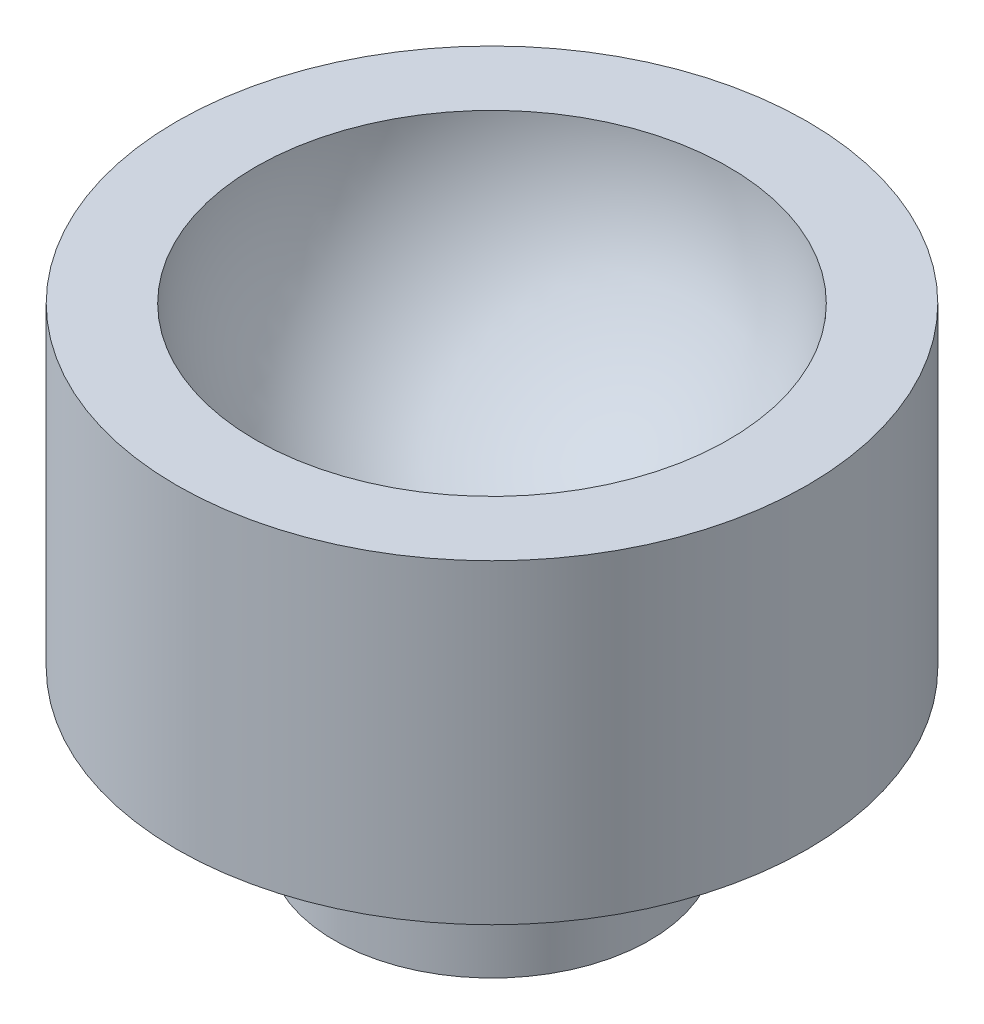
ISO-10303-21;
HEADER;
FILE_DESCRIPTION(('STEP AP214'),'2;1');
FILE_NAME('part.step','',(''),(''),'','','');
FILE_SCHEMA(('AUTOMOTIVE_DESIGN { 1 0 10303 214 1 1 1 1 }'));
ENDSEC;
DATA;
#1=APPLICATION_CONTEXT('core data for automotive mechanical design processes');
#2=APPLICATION_PROTOCOL_DEFINITION('international standard','automotive_design',2000,#1);
#3=PRODUCT_CONTEXT('',#1,'mechanical');
#4=PRODUCT('Part','Part','',(#3));
#5=PRODUCT_RELATED_PRODUCT_CATEGORY('part','',(#4));
#6=PRODUCT_DEFINITION_FORMATION('','',#4);
#7=PRODUCT_DEFINITION_CONTEXT('part definition',#1,'design');
#8=PRODUCT_DEFINITION('design','',#6,#7);
#9=PRODUCT_DEFINITION_SHAPE('','',#8);
#10=(LENGTH_UNIT() NAMED_UNIT(*) SI_UNIT(.MILLI.,.METRE.));
#11=(NAMED_UNIT(*) PLANE_ANGLE_UNIT() SI_UNIT($,.RADIAN.));
#12=(NAMED_UNIT(*) SI_UNIT($,.STERADIAN.) SOLID_ANGLE_UNIT());
#13=UNCERTAINTY_MEASURE_WITH_UNIT(LENGTH_MEASURE(1.E-05),#10,'distance_accuracy_value','');
#14=(GEOMETRIC_REPRESENTATION_CONTEXT(3) GLOBAL_UNCERTAINTY_ASSIGNED_CONTEXT((#13)) GLOBAL_UNIT_ASSIGNED_CONTEXT((#10,
#11,#12)) REPRESENTATION_CONTEXT('',''));
#15=CARTESIAN_POINT('',(0.,0.,0.));
#16=DIRECTION('',(0.,0.,1.));
#17=DIRECTION('',(1.,0.,0.));
#18=AXIS2_PLACEMENT_3D('',#15,#16,#17);
#19=CARTESIAN_POINT('',(0.,0.,0.));
#20=DIRECTION('',(0.,-1.,0.));
#21=DIRECTION('',(0.,0.,-1.));
#22=AXIS2_PLACEMENT_3D('',#19,#20,#21);
#23=PLANE('',#22);
#24=CARTESIAN_POINT('',(0.,0.,0.));
#25=DIRECTION('',(0.,-1.,0.));
#26=DIRECTION('',(0.,0.,-1.));
#27=AXIS2_PLACEMENT_3D('',#24,#25,#26);
#28=CIRCLE('',#27,10.);
#29=CARTESIAN_POINT('',(0.,0.,-10.));
#30=VERTEX_POINT('',#29);
#31=EDGE_CURVE('E10',#30,#30,#28,.T.);
#32=ORIENTED_EDGE('',*,*,#31,.T.);
#33=EDGE_LOOP('',(#32));
#34=FACE_BOUND('',#33,.T.);
#35=ADVANCED_FACE('F31',(#34),#23,.T.);
#36=CARTESIAN_POINT('',(0.,-25.1280260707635,0.));
#37=DIRECTION('',(0.,-1.,0.));
#38=DIRECTION('',(0.,0.,-1.));
#39=AXIS2_PLACEMENT_3D('',#36,#37,#38);
#40=CYLINDRICAL_SURFACE('',#39,10.);
#41=CARTESIAN_POINT('',(0.,10.,0.));
#42=DIRECTION('',(0.,-1.,0.));
#43=DIRECTION('',(0.,0.,-1.));
#44=AXIS2_PLACEMENT_3D('',#41,#42,#43);
#45=CIRCLE('',#44,10.);
#46=CARTESIAN_POINT('',(0.,10.,-10.));
#47=VERTEX_POINT('',#46);
#48=EDGE_CURVE('E38',#47,#47,#45,.T.);
#49=ORIENTED_EDGE('',*,*,#48,.T.);
#50=EDGE_LOOP('',(#49));
#51=FACE_BOUND('',#50,.T.);
#52=ORIENTED_EDGE('',*,*,#31,.F.);
#53=EDGE_LOOP('',(#52));
#54=FACE_BOUND('',#53,.T.);
#55=ADVANCED_FACE('F69',(#51,#54),#40,.T.);
#56=CARTESIAN_POINT('',(10.,10.,0.));
#57=DIRECTION('',(0.,-1.,0.));
#58=DIRECTION('',(0.,0.,-1.));
#59=AXIS2_PLACEMENT_3D('',#56,#57,#58);
#60=PLANE('',#59);
#61=CARTESIAN_POINT('',(0.,10.,0.));
#62=DIRECTION('',(0.,-1.,0.));
#63=DIRECTION('',(0.,0.,-1.));
#64=AXIS2_PLACEMENT_3D('',#61,#62,#63);
#65=CIRCLE('',#64,20.);
#66=CARTESIAN_POINT('',(0.,10.,-20.));
#67=VERTEX_POINT('',#66);
#68=EDGE_CURVE('E42',#67,#67,#65,.T.);
#69=ORIENTED_EDGE('',*,*,#68,.T.);
#70=EDGE_LOOP('',(#69));
#71=FACE_BOUND('',#70,.T.);
#72=ORIENTED_EDGE('',*,*,#48,.F.);
#73=EDGE_LOOP('',(#72));
#74=FACE_BOUND('',#73,.T.);
#75=ADVANCED_FACE('F66',(#71,#74),#60,.T.);
#76=CARTESIAN_POINT('',(0.,-25.1280260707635,0.));
#77=DIRECTION('',(0.,-1.,0.));
#78=DIRECTION('',(0.,0.,-1.));
#79=AXIS2_PLACEMENT_3D('',#76,#77,#78);
#80=CYLINDRICAL_SURFACE('',#79,20.);
#81=CARTESIAN_POINT('',(0.,30.,0.));
#82=DIRECTION('',(0.,-1.,0.));
#83=DIRECTION('',(0.,0.,-1.));
#84=AXIS2_PLACEMENT_3D('',#81,#82,#83);
#85=CIRCLE('',#84,20.);
#86=CARTESIAN_POINT('',(0.,30.,-20.));
#87=VERTEX_POINT('',#86);
#88=EDGE_CURVE('E47',#87,#87,#85,.T.);
#89=ORIENTED_EDGE('',*,*,#88,.T.);
#90=EDGE_LOOP('',(#89));
#91=FACE_BOUND('',#90,.T.);
#92=ORIENTED_EDGE('',*,*,#68,.F.);
#93=EDGE_LOOP('',(#92));
#94=FACE_BOUND('',#93,.T.);
#95=ADVANCED_FACE('F59',(#91,#94),#80,.T.);
#96=CARTESIAN_POINT('',(20.,30.,0.));
#97=DIRECTION('',(0.,1.,0.));
#98=DIRECTION('',(0.,0.,1.));
#99=AXIS2_PLACEMENT_3D('',#96,#97,#98);
#100=PLANE('',#99);
#101=CARTESIAN_POINT('',(0.,30.,0.));
#102=DIRECTION('',(0.,1.,0.));
#103=DIRECTION('',(0.,0.,1.));
#104=AXIS2_PLACEMENT_3D('',#101,#102,#103);
#105=CIRCLE('',#104,14.9993616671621);
#106=CARTESIAN_POINT('',(0.,30.,14.9993616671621));
#107=VERTEX_POINT('',#106);
#108=EDGE_CURVE('E34',#107,#107,#105,.T.);
#109=ORIENTED_EDGE('',*,*,#108,.F.);
#110=EDGE_LOOP('',(#109));
#111=FACE_BOUND('',#110,.T.);
#112=ORIENTED_EDGE('',*,*,#88,.F.);
#113=EDGE_LOOP('',(#112));
#114=FACE_BOUND('',#113,.T.);
#115=ADVANCED_FACE('F56',(#111,#114),#100,.T.);
#116=CARTESIAN_POINT('',(0.,30.1383819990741,0.));
#117=DIRECTION('',(0.,-1.,0.));
#118=DIRECTION('',(-1.,0.,0.));
#119=AXIS2_PLACEMENT_3D('',#116,#117,#118);
#120=SPHERICAL_SURFACE('',#119,15.);
#121=ORIENTED_EDGE('',*,*,#108,.T.);
#122=EDGE_LOOP('',(#121));
#123=FACE_BOUND('',#122,.T.);
#124=ADVANCED_FACE('F54',(#123),#120,.F.);
#125=CLOSED_SHELL('',(#35,#55,#75,#95,#115,#124));
#126=MANIFOLD_SOLID_BREP('B2',#125);
#127=ADVANCED_BREP_SHAPE_REPRESENTATION('',(#18,#126),#14);
#128=SHAPE_DEFINITION_REPRESENTATION(#9,#127);
ENDSEC;
END-ISO-10303-21;
